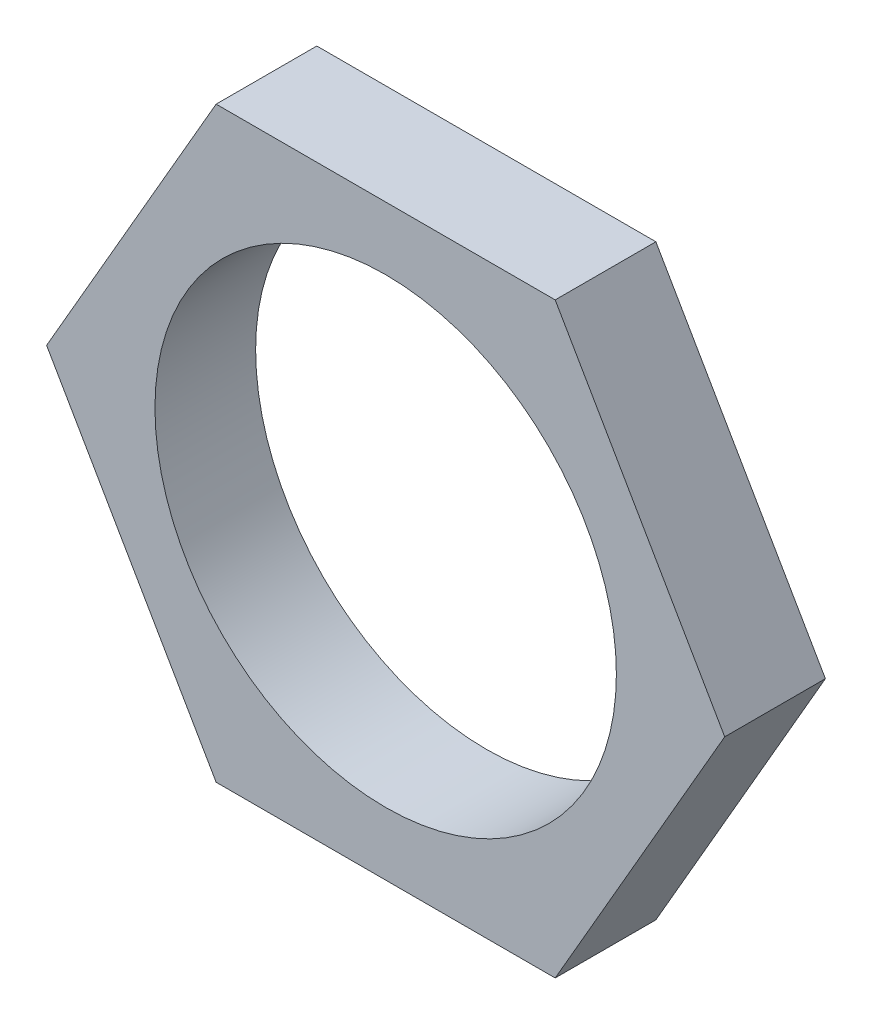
ISO-10303-21;
HEADER;
FILE_DESCRIPTION(('STEP AP214'),'2;1');
FILE_NAME('part.step','',(''),(''),'','','');
FILE_SCHEMA(('AUTOMOTIVE_DESIGN { 1 0 10303 214 1 1 1 1 }'));
ENDSEC;
DATA;
#1=APPLICATION_CONTEXT('core data for automotive mechanical design processes');
#2=APPLICATION_PROTOCOL_DEFINITION('international standard','automotive_design',2000,#1);
#3=PRODUCT_CONTEXT('',#1,'mechanical');
#4=PRODUCT('Part','Part','',(#3));
#5=PRODUCT_RELATED_PRODUCT_CATEGORY('part','',(#4));
#6=PRODUCT_DEFINITION_FORMATION('','',#4);
#7=PRODUCT_DEFINITION_CONTEXT('part definition',#1,'design');
#8=PRODUCT_DEFINITION('design','',#6,#7);
#9=PRODUCT_DEFINITION_SHAPE('','',#8);
#10=(LENGTH_UNIT() NAMED_UNIT(*) SI_UNIT(.MILLI.,.METRE.));
#11=(NAMED_UNIT(*) PLANE_ANGLE_UNIT() SI_UNIT($,.RADIAN.));
#12=(NAMED_UNIT(*) SI_UNIT($,.STERADIAN.) SOLID_ANGLE_UNIT());
#13=UNCERTAINTY_MEASURE_WITH_UNIT(LENGTH_MEASURE(1.E-05),#10,'distance_accuracy_value','');
#14=(GEOMETRIC_REPRESENTATION_CONTEXT(3) GLOBAL_UNCERTAINTY_ASSIGNED_CONTEXT((#13)) GLOBAL_UNIT_ASSIGNED_CONTEXT((#10,
#11,#12)) REPRESENTATION_CONTEXT('',''));
#15=CARTESIAN_POINT('',(0.,0.,0.));
#16=DIRECTION('',(0.,0.,1.));
#17=DIRECTION('',(1.,0.,0.));
#18=AXIS2_PLACEMENT_3D('',#15,#16,#17);
#19=CARTESIAN_POINT('',(-4.04145188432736,7.00000000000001,2.4));
#20=DIRECTION('',(0.,0.,-1.));
#21=DIRECTION('',(-1.,0.,0.));
#22=AXIS2_PLACEMENT_3D('',#19,#20,#21);
#23=PLANE('',#22);
#24=DIRECTION('',(-0.5,-0.866025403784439,0.));
#25=VECTOR('',#24,1.);
#26=CARTESIAN_POINT('',(-4.04145188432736,7.00000000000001,2.4));
#27=LINE('',#26,#25);
#28=CARTESIAN_POINT('',(-4.04145188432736,7.00000000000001,2.4));
#29=VERTEX_POINT('',#28);
#30=CARTESIAN_POINT('',(-8.08290376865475,0.,2.4));
#31=VERTEX_POINT('',#30);
#32=EDGE_CURVE('E132',#29,#31,#27,.T.);
#33=ORIENTED_EDGE('',*,*,#32,.T.);
#34=DIRECTION('',(0.5,-0.866025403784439,0.));
#35=VECTOR('',#34,1.);
#36=CARTESIAN_POINT('',(-8.08290376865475,0.,2.4));
#37=LINE('',#36,#35);
#38=CARTESIAN_POINT('',(-4.04145188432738,-7.00000000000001,2.4));
#39=VERTEX_POINT('',#38);
#40=EDGE_CURVE('E90',#31,#39,#37,.T.);
#41=ORIENTED_EDGE('',*,*,#40,.T.);
#42=DIRECTION('',(1.,0.,0.));
#43=VECTOR('',#42,1.);
#44=CARTESIAN_POINT('',(-4.04145188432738,-7.00000000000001,2.4));
#45=LINE('',#44,#43);
#46=CARTESIAN_POINT('',(4.04145188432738,-7.00000000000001,2.4));
#47=VERTEX_POINT('',#46);
#48=EDGE_CURVE('E103',#39,#47,#45,.T.);
#49=ORIENTED_EDGE('',*,*,#48,.T.);
#50=DIRECTION('',(0.5,0.866025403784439,0.));
#51=VECTOR('',#50,1.);
#52=CARTESIAN_POINT('',(4.04145188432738,-7.00000000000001,2.4));
#53=LINE('',#52,#51);
#54=CARTESIAN_POINT('',(8.08290376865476,0.,2.4));
#55=VERTEX_POINT('',#54);
#56=EDGE_CURVE('E97',#47,#55,#53,.T.);
#57=ORIENTED_EDGE('',*,*,#56,.T.);
#58=DIRECTION('',(-0.5,0.866025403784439,0.));
#59=VECTOR('',#58,1.);
#60=CARTESIAN_POINT('',(8.08290376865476,0.,2.4));
#61=LINE('',#60,#59);
#62=CARTESIAN_POINT('',(4.04145188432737,7.00000000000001,2.4));
#63=VERTEX_POINT('',#62);
#64=EDGE_CURVE('E101',#55,#63,#61,.T.);
#65=ORIENTED_EDGE('',*,*,#64,.T.);
#66=DIRECTION('',(-1.,0.,0.));
#67=VECTOR('',#66,1.);
#68=CARTESIAN_POINT('',(4.04145188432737,7.00000000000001,2.4));
#69=LINE('',#68,#67);
#70=EDGE_CURVE('E53',#63,#29,#69,.T.);
#71=ORIENTED_EDGE('',*,*,#70,.T.);
#72=EDGE_LOOP('',(#33,#41,#49,#57,#65,#71));
#73=FACE_BOUND('',#72,.T.);
#74=CARTESIAN_POINT('',(0.,0.,2.4));
#75=DIRECTION('',(0.,0.,1.));
#76=DIRECTION('',(1.,0.,0.));
#77=AXIS2_PLACEMENT_3D('',#74,#75,#76);
#78=CIRCLE('',#77,5.5);
#79=CARTESIAN_POINT('',(5.5,0.,2.4));
#80=VERTEX_POINT('',#79);
#81=EDGE_CURVE('E125',#80,#80,#78,.T.);
#82=ORIENTED_EDGE('',*,*,#81,.F.);
#83=EDGE_LOOP('',(#82));
#84=FACE_BOUND('',#83,.T.);
#85=ADVANCED_FACE('F36',(#73,#84),#23,.F.);
#86=CARTESIAN_POINT('',(-4.04145188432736,7.00000000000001,0.));
#87=DIRECTION('',(0.,0.,-1.));
#88=DIRECTION('',(-1.,0.,0.));
#89=AXIS2_PLACEMENT_3D('',#86,#87,#88);
#90=PLANE('',#89);
#91=DIRECTION('',(-0.5,-0.866025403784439,0.));
#92=VECTOR('',#91,1.);
#93=CARTESIAN_POINT('',(-4.04145188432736,7.00000000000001,0.));
#94=LINE('',#93,#92);
#95=CARTESIAN_POINT('',(-4.04145188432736,7.00000000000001,0.));
#96=VERTEX_POINT('',#95);
#97=CARTESIAN_POINT('',(-8.08290376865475,0.,0.));
#98=VERTEX_POINT('',#97);
#99=EDGE_CURVE('E121',#96,#98,#94,.T.);
#100=ORIENTED_EDGE('',*,*,#99,.F.);
#101=DIRECTION('',(-1.,0.,0.));
#102=VECTOR('',#101,1.);
#103=CARTESIAN_POINT('',(4.04145188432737,7.00000000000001,0.));
#104=LINE('',#103,#102);
#105=CARTESIAN_POINT('',(4.04145188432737,7.00000000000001,0.));
#106=VERTEX_POINT('',#105);
#107=EDGE_CURVE('E82',#106,#96,#104,.T.);
#108=ORIENTED_EDGE('',*,*,#107,.F.);
#109=DIRECTION('',(-0.5,0.866025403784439,0.));
#110=VECTOR('',#109,1.);
#111=CARTESIAN_POINT('',(8.08290376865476,0.,0.));
#112=LINE('',#111,#110);
#113=CARTESIAN_POINT('',(8.08290376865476,0.,0.));
#114=VERTEX_POINT('',#113);
#115=EDGE_CURVE('E76',#114,#106,#112,.T.);
#116=ORIENTED_EDGE('',*,*,#115,.F.);
#117=DIRECTION('',(0.5,0.866025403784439,0.));
#118=VECTOR('',#117,1.);
#119=CARTESIAN_POINT('',(4.04145188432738,-7.00000000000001,0.));
#120=LINE('',#119,#118);
#121=CARTESIAN_POINT('',(4.04145188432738,-7.00000000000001,0.));
#122=VERTEX_POINT('',#121);
#123=EDGE_CURVE('E111',#122,#114,#120,.T.);
#124=ORIENTED_EDGE('',*,*,#123,.F.);
#125=DIRECTION('',(1.,0.,0.));
#126=VECTOR('',#125,1.);
#127=CARTESIAN_POINT('',(-4.04145188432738,-7.00000000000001,0.));
#128=LINE('',#127,#126);
#129=CARTESIAN_POINT('',(-4.04145188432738,-7.00000000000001,0.));
#130=VERTEX_POINT('',#129);
#131=EDGE_CURVE('E127',#130,#122,#128,.T.);
#132=ORIENTED_EDGE('',*,*,#131,.F.);
#133=DIRECTION('',(0.5,-0.866025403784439,0.));
#134=VECTOR('',#133,1.);
#135=CARTESIAN_POINT('',(-8.08290376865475,0.,0.));
#136=LINE('',#135,#134);
#137=EDGE_CURVE('E124',#98,#130,#136,.T.);
#138=ORIENTED_EDGE('',*,*,#137,.F.);
#139=EDGE_LOOP('',(#100,#108,#116,#124,#132,#138));
#140=FACE_BOUND('',#139,.T.);
#141=CARTESIAN_POINT('',(0.,0.,0.));
#142=DIRECTION('',(0.,0.,1.));
#143=DIRECTION('',(1.,0.,0.));
#144=AXIS2_PLACEMENT_3D('',#141,#142,#143);
#145=CIRCLE('',#144,5.5);
#146=CARTESIAN_POINT('',(5.5,0.,0.));
#147=VERTEX_POINT('',#146);
#148=EDGE_CURVE('E225',#147,#147,#145,.T.);
#149=ORIENTED_EDGE('',*,*,#148,.T.);
#150=EDGE_LOOP('',(#149));
#151=FACE_BOUND('',#150,.T.);
#152=ADVANCED_FACE('F141',(#140,#151),#90,.T.);
#153=CARTESIAN_POINT('',(-4.04145188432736,7.00000000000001,2.4));
#154=DIRECTION('',(0.866025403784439,-0.5,0.));
#155=DIRECTION('',(0.5,0.866025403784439,0.));
#156=AXIS2_PLACEMENT_3D('',#153,#154,#155);
#157=PLANE('',#156);
#158=ORIENTED_EDGE('',*,*,#99,.T.);
#159=DIRECTION('',(0.,0.,-1.));
#160=VECTOR('',#159,1.);
#161=CARTESIAN_POINT('',(-8.08290376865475,0.,2.4));
#162=LINE('',#161,#160);
#163=EDGE_CURVE('E11',#31,#98,#162,.T.);
#164=ORIENTED_EDGE('',*,*,#163,.F.);
#165=ORIENTED_EDGE('',*,*,#32,.F.);
#166=DIRECTION('',(0.,0.,-1.));
#167=VECTOR('',#166,1.);
#168=CARTESIAN_POINT('',(-4.04145188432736,7.00000000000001,2.4));
#169=LINE('',#168,#167);
#170=EDGE_CURVE('E117',#29,#96,#169,.T.);
#171=ORIENTED_EDGE('',*,*,#170,.T.);
#172=EDGE_LOOP('',(#158,#164,#165,#171));
#173=FACE_BOUND('',#172,.T.);
#174=ADVANCED_FACE('F38',(#173),#157,.F.);
#175=CARTESIAN_POINT('',(-8.08290376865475,0.,2.4));
#176=DIRECTION('',(0.866025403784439,0.5,0.));
#177=DIRECTION('',(-0.5,0.866025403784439,0.));
#178=AXIS2_PLACEMENT_3D('',#175,#176,#177);
#179=PLANE('',#178);
#180=ORIENTED_EDGE('',*,*,#137,.T.);
#181=DIRECTION('',(0.,0.,-1.));
#182=VECTOR('',#181,1.);
#183=CARTESIAN_POINT('',(-4.04145188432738,-7.00000000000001,2.4));
#184=LINE('',#183,#182);
#185=EDGE_CURVE('E45',#39,#130,#184,.T.);
#186=ORIENTED_EDGE('',*,*,#185,.F.);
#187=ORIENTED_EDGE('',*,*,#40,.F.);
#188=ORIENTED_EDGE('',*,*,#163,.T.);
#189=EDGE_LOOP('',(#180,#186,#187,#188));
#190=FACE_BOUND('',#189,.T.);
#191=ADVANCED_FACE('F166',(#190),#179,.F.);
#192=CARTESIAN_POINT('',(-4.04145188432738,-7.00000000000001,2.4));
#193=DIRECTION('',(0.,1.,0.));
#194=DIRECTION('',(-1.,0.,0.));
#195=AXIS2_PLACEMENT_3D('',#192,#193,#194);
#196=PLANE('',#195);
#197=ORIENTED_EDGE('',*,*,#131,.T.);
#198=DIRECTION('',(0.,0.,-1.));
#199=VECTOR('',#198,1.);
#200=CARTESIAN_POINT('',(4.04145188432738,-7.00000000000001,2.4));
#201=LINE('',#200,#199);
#202=EDGE_CURVE('E112',#47,#122,#201,.T.);
#203=ORIENTED_EDGE('',*,*,#202,.F.);
#204=ORIENTED_EDGE('',*,*,#48,.F.);
#205=ORIENTED_EDGE('',*,*,#185,.T.);
#206=EDGE_LOOP('',(#197,#203,#204,#205));
#207=FACE_BOUND('',#206,.T.);
#208=ADVANCED_FACE('F138',(#207),#196,.F.);
#209=CARTESIAN_POINT('',(4.04145188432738,-7.00000000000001,2.4));
#210=DIRECTION('',(-0.866025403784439,0.5,0.));
#211=DIRECTION('',(-0.5,-0.866025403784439,0.));
#212=AXIS2_PLACEMENT_3D('',#209,#210,#211);
#213=PLANE('',#212);
#214=ORIENTED_EDGE('',*,*,#123,.T.);
#215=DIRECTION('',(0.,0.,-1.));
#216=VECTOR('',#215,1.);
#217=CARTESIAN_POINT('',(8.08290376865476,0.,2.4));
#218=LINE('',#217,#216);
#219=EDGE_CURVE('E108',#55,#114,#218,.T.);
#220=ORIENTED_EDGE('',*,*,#219,.F.);
#221=ORIENTED_EDGE('',*,*,#56,.F.);
#222=ORIENTED_EDGE('',*,*,#202,.T.);
#223=EDGE_LOOP('',(#214,#220,#221,#222));
#224=FACE_BOUND('',#223,.T.);
#225=ADVANCED_FACE('F109',(#224),#213,.F.);
#226=CARTESIAN_POINT('',(8.08290376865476,0.,2.4));
#227=DIRECTION('',(-0.866025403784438,-0.5,0.));
#228=DIRECTION('',(0.5,-0.866025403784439,0.));
#229=AXIS2_PLACEMENT_3D('',#226,#227,#228);
#230=PLANE('',#229);
#231=ORIENTED_EDGE('',*,*,#115,.T.);
#232=DIRECTION('',(0.,0.,-1.));
#233=VECTOR('',#232,1.);
#234=CARTESIAN_POINT('',(4.04145188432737,7.00000000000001,2.4));
#235=LINE('',#234,#233);
#236=EDGE_CURVE('E113',#63,#106,#235,.T.);
#237=ORIENTED_EDGE('',*,*,#236,.F.);
#238=ORIENTED_EDGE('',*,*,#64,.F.);
#239=ORIENTED_EDGE('',*,*,#219,.T.);
#240=EDGE_LOOP('',(#231,#237,#238,#239));
#241=FACE_BOUND('',#240,.T.);
#242=ADVANCED_FACE('F115',(#241),#230,.F.);
#243=CARTESIAN_POINT('',(4.04145188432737,7.00000000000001,2.4));
#244=DIRECTION('',(0.,-1.,0.));
#245=DIRECTION('',(0.,0.,-1.));
#246=AXIS2_PLACEMENT_3D('',#243,#244,#245);
#247=PLANE('',#246);
#248=ORIENTED_EDGE('',*,*,#107,.T.);
#249=ORIENTED_EDGE('',*,*,#170,.F.);
#250=ORIENTED_EDGE('',*,*,#70,.F.);
#251=ORIENTED_EDGE('',*,*,#236,.T.);
#252=EDGE_LOOP('',(#248,#249,#250,#251));
#253=FACE_BOUND('',#252,.T.);
#254=ADVANCED_FACE('F146',(#253),#247,.F.);
#255=CARTESIAN_POINT('',(0.,0.,2.4));
#256=DIRECTION('',(0.,0.,-1.));
#257=DIRECTION('',(-1.,0.,0.));
#258=AXIS2_PLACEMENT_3D('',#255,#256,#257);
#259=CYLINDRICAL_SURFACE('',#258,5.5);
#260=ORIENTED_EDGE('',*,*,#81,.T.);
#261=EDGE_LOOP('',(#260));
#262=FACE_BOUND('',#261,.T.);
#263=ORIENTED_EDGE('',*,*,#148,.F.);
#264=EDGE_LOOP('',(#263));
#265=FACE_BOUND('',#264,.T.);
#266=ADVANCED_FACE('F148',(#262,#265),#259,.F.);
#267=CLOSED_SHELL('',(#85,#152,#174,#191,#208,#225,#242,#254,#266));
#268=MANIFOLD_SOLID_BREP('B2',#267);
#269=ADVANCED_BREP_SHAPE_REPRESENTATION('',(#18,#268),#14);
#270=SHAPE_DEFINITION_REPRESENTATION(#9,#269);
ENDSEC;
END-ISO-10303-21;
